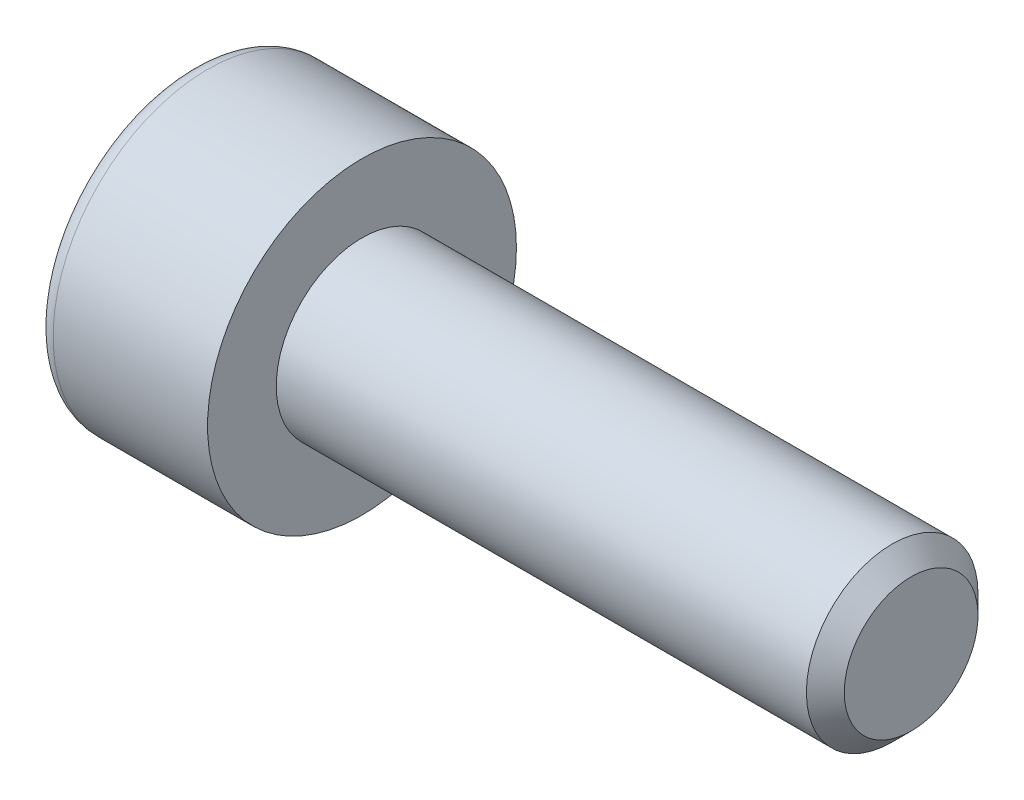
ISO-10303-21;
HEADER;
FILE_DESCRIPTION(('STEP AP214'),'2;1');
FILE_NAME('part.step','',(''),(''),'','','');
FILE_SCHEMA(('AUTOMOTIVE_DESIGN { 1 0 10303 214 1 1 1 1 }'));
ENDSEC;
DATA;
#1=APPLICATION_CONTEXT('core data for automotive mechanical design processes');
#2=APPLICATION_PROTOCOL_DEFINITION('international standard','automotive_design',2000,#1);
#3=PRODUCT_CONTEXT('',#1,'mechanical');
#4=PRODUCT('Part','Part','',(#3));
#5=PRODUCT_RELATED_PRODUCT_CATEGORY('part','',(#4));
#6=PRODUCT_DEFINITION_FORMATION('','',#4);
#7=PRODUCT_DEFINITION_CONTEXT('part definition',#1,'design');
#8=PRODUCT_DEFINITION('design','',#6,#7);
#9=PRODUCT_DEFINITION_SHAPE('','',#8);
#10=(LENGTH_UNIT() NAMED_UNIT(*) SI_UNIT(.MILLI.,.METRE.));
#11=(NAMED_UNIT(*) PLANE_ANGLE_UNIT() SI_UNIT($,.RADIAN.));
#12=(NAMED_UNIT(*) SI_UNIT($,.STERADIAN.) SOLID_ANGLE_UNIT());
#13=UNCERTAINTY_MEASURE_WITH_UNIT(LENGTH_MEASURE(1.E-05),#10,'distance_accuracy_value','');
#14=(GEOMETRIC_REPRESENTATION_CONTEXT(3) GLOBAL_UNCERTAINTY_ASSIGNED_CONTEXT((#13)) GLOBAL_UNIT_ASSIGNED_CONTEXT((#10,
#11,#12)) REPRESENTATION_CONTEXT('',''));
#15=CARTESIAN_POINT('',(0.,0.,0.));
#16=DIRECTION('',(0.,0.,1.));
#17=DIRECTION('',(1.,0.,0.));
#18=AXIS2_PLACEMENT_3D('',#15,#16,#17);
#19=CARTESIAN_POINT('',(-0.849999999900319,0.,0.));
#20=DIRECTION('',(-1.,0.,0.));
#21=DIRECTION('',(0.,-1.,0.));
#22=AXIS2_PLACEMENT_3D('',#19,#20,#21);
#23=CONICAL_SURFACE('',#22,0.952380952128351,1.04719755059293);
#24=CARTESIAN_POINT('',(-0.300142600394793,-3.97903932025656E-10,0.));
#25=VERTEX_POINT('',#24);
#26=VERTEX_LOOP('',#25);
#27=FACE_BOUND('',#26,.T.);
#28=CARTESIAN_POINT('',(-0.850000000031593,0.,0.));
#29=DIRECTION('',(-1.,0.,0.));
#30=DIRECTION('',(0.,-1.,0.));
#31=AXIS2_PLACEMENT_3D('',#28,#29,#30);
#32=CIRCLE('',#31,0.952380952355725);
#33=CARTESIAN_POINT('',(-0.850000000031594,-0.952380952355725,0.));
#34=VERTEX_POINT('',#33);
#35=EDGE_CURVE('E362',#34,#34,#32,.T.);
#36=ORIENTED_EDGE('',*,*,#35,.T.);
#37=EDGE_LOOP('',(#36));
#38=FACE_BOUND('',#37,.T.);
#39=ADVANCED_FACE('F17',(#27,#38),#23,.F.);
#40=CARTESIAN_POINT('',(-0.85,0.574463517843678,0.995));
#41=DIRECTION('',(0.,0.,1.));
#42=DIRECTION('',(1.,0.,0.));
#43=AXIS2_PLACEMENT_3D('',#40,#41,#42);
#44=PLANE('',#43);
#45=DIRECTION('',(1.,0.,0.));
#46=VECTOR('',#45,1.);
#47=CARTESIAN_POINT('',(-0.85,-0.574463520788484,0.994999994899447));
#48=LINE('',#47,#46);
#49=CARTESIAN_POINT('',(-0.85,-0.574463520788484,0.994999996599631));
#50=VERTEX_POINT('',#49);
#51=CARTESIAN_POINT('',(-2.4989270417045,-0.574463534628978,0.994999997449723));
#52=VERTEX_POINT('',#51);
#53=EDGE_CURVE('E276',#50,#52,#48,.F.);
#54=ORIENTED_EDGE('',*,*,#53,.T.);
#55=CARTESIAN_POINT('',(-2.34499999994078,0.,0.995000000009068));
#56=CARTESIAN_POINT('',(-2.34497439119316,-0.0305677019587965,0.995000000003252));
#57=CARTESIAN_POINT('',(-2.34640800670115,-0.0611198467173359,0.99500000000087));
#58=CARTESIAN_POINT('',(-2.35199243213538,-0.1219221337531,0.994999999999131));
#59=CARTESIAN_POINT('',(-2.35613836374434,-0.152172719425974,0.994999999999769));
#60=CARTESIAN_POINT('',(-2.36686597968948,-0.211759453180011,0.995000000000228));
#61=CARTESIAN_POINT('',(-2.3734099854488,-0.241102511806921,0.995000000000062));
#62=CARTESIAN_POINT('',(-2.38864217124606,-0.299229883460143,0.994999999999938));
#63=CARTESIAN_POINT('',(-2.39733102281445,-0.328014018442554,0.99499999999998));
#64=CARTESIAN_POINT('',(-2.41947932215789,-0.393688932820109,0.995000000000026));
#65=CARTESIAN_POINT('',(-2.43358464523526,-0.430359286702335,0.995000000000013));
#66=CARTESIAN_POINT('',(-2.46443795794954,-0.503023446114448,0.994999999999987));
#67=CARTESIAN_POINT('',(-2.48121157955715,-0.539006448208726,0.994999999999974));
#68=CARTESIAN_POINT('',(-2.49892704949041,-0.574463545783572,0.995));
#69=B_SPLINE_CURVE_WITH_KNOTS('',3,(#55,#56,#57,#58,#59,#60,#61,#62,#63,#64,#65,#66,#67,#68),
.UNSPECIFIED.,.F.,.F.,(4,2,2,2,2,2,4),(0.,0.0916446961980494,0.183125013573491,
0.273225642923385,0.36335451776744,0.48111795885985,0.600089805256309),.UNSPECIFIED.);
#70=CARTESIAN_POINT('',(-2.3449999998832,0.,0.99500000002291));
#71=VERTEX_POINT('',#70);
#72=EDGE_CURVE('E95',#71,#52,#69,.T.);
#73=ORIENTED_EDGE('',*,*,#72,.F.);
#74=CARTESIAN_POINT('',(-2.49892703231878,0.574463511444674,0.995));
#75=CARTESIAN_POINT('',(-2.47907510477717,0.53472221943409,0.995));
#76=CARTESIAN_POINT('',(-2.46039598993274,0.494309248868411,0.995));
#77=CARTESIAN_POINT('',(-2.42621425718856,0.41187206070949,0.995));
#78=CARTESIAN_POINT('',(-2.41073261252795,0.369839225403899,0.995));
#79=CARTESIAN_POINT('',(-2.38444123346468,0.285641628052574,0.995));
#80=CARTESIAN_POINT('',(-2.37350879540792,0.243516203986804,0.995));
#81=CARTESIAN_POINT('',(-2.35666503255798,0.158361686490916,0.995));
#82=CARTESIAN_POINT('',(-2.35073836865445,0.115335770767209,0.995));
#83=CARTESIAN_POINT('',(-2.34674431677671,0.0601561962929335,0.995));
#84=CARTESIAN_POINT('',(-2.34609249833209,0.0481633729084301,0.995));
#85=CARTESIAN_POINT('',(-2.34521965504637,0.0241145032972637,0.995));
#86=CARTESIAN_POINT('',(-2.34500034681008,0.0120583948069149,0.995));
#87=CARTESIAN_POINT('',(-2.34499999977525,0.,0.995));
#88=B_SPLINE_CURVE_WITH_KNOTS('',3,(#74,#75,#76,#77,#78,#79,#80,#81,#82,#83,#84,#85,#86,#87),
.UNSPECIFIED.,.F.,.F.,(4,2,2,2,2,2,4),(0.,0.133369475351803,0.267587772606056,0.397905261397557,
0.527821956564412,0.563847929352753,0.600016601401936),.UNSPECIFIED.);
#89=CARTESIAN_POINT('',(-2.49892703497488,0.574463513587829,0.995000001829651));
#90=VERTEX_POINT('',#89);
#91=EDGE_CURVE('E89',#90,#71,#88,.T.);
#92=ORIENTED_EDGE('',*,*,#91,.F.);
#93=DIRECTION('',(1.,0.,0.));
#94=VECTOR('',#93,1.);
#95=CARTESIAN_POINT('',(-0.85,0.574463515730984,0.995000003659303));
#96=LINE('',#95,#94);
#97=CARTESIAN_POINT('',(-0.85,0.574463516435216,0.995000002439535));
#98=VERTEX_POINT('',#97);
#99=EDGE_CURVE('E93',#90,#98,#96,.T.);
#100=ORIENTED_EDGE('',*,*,#99,.T.);
#101=DIRECTION('',(0.,1.,0.));
#102=VECTOR('',#101,1.);
#103=CARTESIAN_POINT('',(-0.85,0.,0.995));
#104=LINE('',#103,#102);
#105=EDGE_CURVE('E107',#98,#50,#104,.F.);
#106=ORIENTED_EDGE('',*,*,#105,.T.);
#107=EDGE_LOOP('',(#54,#73,#92,#100,#106));
#108=FACE_BOUND('',#107,.T.);
#109=ADVANCED_FACE('F92',(#108),#44,.F.);
#110=CARTESIAN_POINT('',(-0.85,0.,0.));
#111=DIRECTION('',(1.,0.,0.));
#112=DIRECTION('',(0.,0.,-1.));
#113=AXIS2_PLACEMENT_3D('',#110,#111,#112);
#114=PLANE('',#113);
#115=DIRECTION('',(0.,1.,0.));
#116=VECTOR('',#115,1.);
#117=CARTESIAN_POINT('',(-0.85,-0.574463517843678,-0.995));
#118=LINE('',#117,#116);
#119=CARTESIAN_POINT('',(-0.85,0.574463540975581,-0.994999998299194));
#120=VERTEX_POINT('',#119);
#121=CARTESIAN_POINT('',(-0.85,-0.5744635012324,-0.995000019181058));
#122=VERTEX_POINT('',#121);
#123=EDGE_CURVE('E266',#120,#122,#118,.F.);
#124=ORIENTED_EDGE('',*,*,#123,.T.);
#125=DIRECTION('',(0.,0.5,-0.866025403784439));
#126=VECTOR('',#125,1.);
#127=CARTESIAN_POINT('',(-0.85,-1.14892703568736,0.));
#128=LINE('',#127,#126);
#129=CARTESIAN_POINT('',(-0.85,-1.14892703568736,0.));
#130=VERTEX_POINT('',#129);
#131=EDGE_CURVE('E115',#122,#130,#128,.F.);
#132=ORIENTED_EDGE('',*,*,#131,.T.);
#133=DIRECTION('',(0.,-0.5,-0.866025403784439));
#134=VECTOR('',#133,1.);
#135=CARTESIAN_POINT('',(-0.85,-0.574463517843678,0.995));
#136=LINE('',#135,#134);
#137=EDGE_CURVE('E368',#130,#50,#136,.F.);
#138=ORIENTED_EDGE('',*,*,#137,.T.);
#139=ORIENTED_EDGE('',*,*,#105,.F.);
#140=DIRECTION('',(0.,-0.5,0.866025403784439));
#141=VECTOR('',#140,1.);
#142=CARTESIAN_POINT('',(-0.85,1.14892703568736,0.));
#143=LINE('',#142,#141);
#144=CARTESIAN_POINT('',(-0.85,1.14892703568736,0.));
#145=VERTEX_POINT('',#144);
#146=EDGE_CURVE('E106',#98,#145,#143,.F.);
#147=ORIENTED_EDGE('',*,*,#146,.T.);
#148=DIRECTION('',(0.,0.5,0.866025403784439));
#149=VECTOR('',#148,1.);
#150=CARTESIAN_POINT('',(-0.85,0.574463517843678,-0.995));
#151=LINE('',#150,#149);
#152=EDGE_CURVE('E268',#145,#120,#151,.F.);
#153=ORIENTED_EDGE('',*,*,#152,.T.);
#154=EDGE_LOOP('',(#124,#132,#138,#139,#147,#153));
#155=FACE_BOUND('',#154,.T.);
#156=ORIENTED_EDGE('',*,*,#35,.F.);
#157=EDGE_LOOP('',(#156));
#158=FACE_BOUND('',#157,.T.);
#159=ADVANCED_FACE('F165',(#155,#158),#114,.F.);
#160=CARTESIAN_POINT('',(-0.85,1.14892703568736,0.));
#161=DIRECTION('',(0.,0.866025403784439,0.5));
#162=DIRECTION('',(0.,-0.5,0.866025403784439));
#163=AXIS2_PLACEMENT_3D('',#160,#161,#162);
#164=PLANE('',#163);
#165=ORIENTED_EDGE('',*,*,#99,.F.);
#166=CARTESIAN_POINT('',(-2.49892703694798,0.574463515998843,0.995000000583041));
#167=CARTESIAN_POINT('',(-2.47920127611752,0.594208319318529,0.960800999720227));
#168=CARTESIAN_POINT('',(-2.46063414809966,0.614283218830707,0.926030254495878));
#169=CARTESIAN_POINT('',(-2.4266385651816,0.655218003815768,0.855129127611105));
#170=CARTESIAN_POINT('',(-2.41122901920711,0.676081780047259,0.818992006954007));
#171=CARTESIAN_POINT('',(-2.38483287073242,0.71815225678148,0.746123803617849));
#172=CARTESIAN_POINT('',(-2.37377985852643,0.739348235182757,0.709411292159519));
#173=CARTESIAN_POINT('',(-2.35674986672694,0.782206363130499,0.635178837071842));
#174=CARTESIAN_POINT('',(-2.35076018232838,0.803867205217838,0.59766115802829));
#175=CARTESIAN_POINT('',(-2.34535763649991,0.841202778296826,0.532994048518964));
#176=CARTESIAN_POINT('',(-2.34455932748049,0.856829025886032,0.505928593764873));
#177=CARTESIAN_POINT('',(-2.34590474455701,0.888051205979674,0.451850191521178));
#178=CARTESIAN_POINT('',(-2.34804912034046,0.90364713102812,0.424837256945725));
#179=CARTESIAN_POINT('',(-2.35875462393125,0.950212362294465,0.344183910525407));
#180=CARTESIAN_POINT('',(-2.37158937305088,0.9809498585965,0.290945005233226));
#181=CARTESIAN_POINT('',(-2.40257138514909,1.03491361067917,0.197477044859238));
#182=CARTESIAN_POINT('',(-2.41909924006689,1.05839226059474,0.156810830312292));
#183=CARTESIAN_POINT('',(-2.4563312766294,1.10442922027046,0.0770724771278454));
#184=CARTESIAN_POINT('',(-2.47702183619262,1.12699025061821,0.0379956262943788));
#185=CARTESIAN_POINT('',(-2.49914390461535,1.14914384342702,-0.000375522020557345));
#186=B_SPLINE_CURVE_WITH_KNOTS('',3,(#166,#167,#168,#169,#170,#171,#172,#173,#174,#175,#176,
#177,#178,#179,#180,#181,#182,#183,#184,#185),.UNSPECIFIED.,.F.,.F.,(4,2,2,2,2,2,2,2,2,4),(0.,
0.132518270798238,0.265808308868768,0.396979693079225,0.527820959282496,0.621473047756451,
0.715145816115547,0.902546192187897,1.05168981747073,1.20035309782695),.UNSPECIFIED.);
#187=CARTESIAN_POINT('',(-2.49966772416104,1.14925824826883,-7.0398023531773E-06));
#188=VERTEX_POINT('',#187);
#189=EDGE_CURVE('E104',#90,#188,#186,.T.);
#190=ORIENTED_EDGE('',*,*,#189,.T.);
#191=DIRECTION('',(1.,0.,0.));
#192=VECTOR('',#191,1.);
#193=CARTESIAN_POINT('',(-0.85,1.14892703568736,0.));
#194=LINE('',#193,#192);
#195=EDGE_CURVE('E367',#188,#145,#194,.T.);
#196=ORIENTED_EDGE('',*,*,#195,.T.);
#197=ORIENTED_EDGE('',*,*,#146,.F.);
#198=EDGE_LOOP('',(#165,#190,#196,#197));
#199=FACE_BOUND('',#198,.T.);
#200=ADVANCED_FACE('F102',(#199),#164,.F.);
#201=CARTESIAN_POINT('',(-0.85,-0.574463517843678,0.995));
#202=DIRECTION('',(0.,-0.866025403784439,0.5));
#203=DIRECTION('',(0.,-0.5,-0.866025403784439));
#204=AXIS2_PLACEMENT_3D('',#201,#202,#203);
#205=PLANE('',#204);
#206=DIRECTION('',(-1.,0.,0.));
#207=VECTOR('',#206,1.);
#208=CARTESIAN_POINT('',(-0.85,-1.14892703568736,0.));
#209=LINE('',#208,#207);
#210=CARTESIAN_POINT('',(-2.49966773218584,-1.14925825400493,-7.06998222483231E-06));
#211=VERTEX_POINT('',#210);
#212=EDGE_CURVE('E138',#130,#211,#209,.T.);
#213=ORIENTED_EDGE('',*,*,#212,.T.);
#214=CARTESIAN_POINT('',(-2.49914391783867,-1.14914385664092,-0.000375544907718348));
#215=CARTESIAN_POINT('',(-2.47939437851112,-1.12938634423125,0.0338454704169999));
#216=CARTESIAN_POINT('',(-2.46080382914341,-1.10929839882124,0.0686388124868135));
#217=CARTESIAN_POINT('',(-2.42676345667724,-1.06833625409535,0.139587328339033));
#218=CARTESIAN_POINT('',(-2.41133259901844,-1.04745814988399,0.175749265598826));
#219=CARTESIAN_POINT('',(-2.38489828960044,-1.00535786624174,0.248669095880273));
#220=CARTESIAN_POINT('',(-2.373828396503,-0.984146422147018,0.285408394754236));
#221=CARTESIAN_POINT('',(-2.35677144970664,-0.941256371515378,0.359696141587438));
#222=CARTESIAN_POINT('',(-2.35077164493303,-0.919579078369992,0.397242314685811));
#223=CARTESIAN_POINT('',(-2.34536074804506,-0.88222607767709,0.461939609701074));
#224=CARTESIAN_POINT('',(-2.34456000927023,-0.866599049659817,0.489006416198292));
#225=CARTESIAN_POINT('',(-2.34590089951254,-0.835375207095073,0.543087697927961));
#226=CARTESIAN_POINT('',(-2.34804317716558,-0.819778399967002,0.570102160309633));
#227=CARTESIAN_POINT('',(-2.35874295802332,-0.773210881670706,0.650759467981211));
#228=CARTESIAN_POINT('',(-2.37157459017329,-0.742471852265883,0.704001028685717));
#229=CARTESIAN_POINT('',(-2.40253243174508,-0.688540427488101,0.797412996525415));
#230=CARTESIAN_POINT('',(-2.41903073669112,-0.665094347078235,0.838022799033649));
#231=CARTESIAN_POINT('',(-2.45619424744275,-0.619119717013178,0.91765319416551));
#232=CARTESIAN_POINT('',(-2.47684592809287,-0.596588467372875,0.956678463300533));
#233=CARTESIAN_POINT('',(-2.49892698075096,-0.574463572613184,0.994999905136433));
#234=B_SPLINE_CURVE_WITH_KNOTS('',3,(#214,#215,#216,#217,#218,#219,#220,#221,#222,#223,#224,
#225,#226,#227,#228,#229,#230,#231,#232,#233),.UNSPECIFIED.,.F.,.F.,(4,2,2,2,2,2,2,2,2,4),(0.,
0.132618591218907,0.266011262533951,0.397284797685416,0.528227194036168,0.621884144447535,
0.715561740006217,0.9029688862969,1.05189958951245,1.2003529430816),.UNSPECIFIED.);
#235=EDGE_CURVE('E117',#211,#52,#234,.T.);
#236=ORIENTED_EDGE('',*,*,#235,.T.);
#237=ORIENTED_EDGE('',*,*,#53,.F.);
#238=ORIENTED_EDGE('',*,*,#137,.F.);
#239=EDGE_LOOP('',(#213,#236,#237,#238));
#240=FACE_BOUND('',#239,.T.);
#241=ADVANCED_FACE('F174',(#240),#205,.F.);
#242=CARTESIAN_POINT('',(-0.85,0.574463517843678,-0.995));
#243=DIRECTION('',(0.,0.866025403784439,-0.5));
#244=DIRECTION('',(0.,0.5,0.866025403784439));
#245=AXIS2_PLACEMENT_3D('',#242,#243,#244);
#246=PLANE('',#245);
#247=ORIENTED_EDGE('',*,*,#195,.F.);
#248=CARTESIAN_POINT('',(-2.49913902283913,1.14913896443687,0.00036707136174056));
#249=CARTESIAN_POINT('',(-2.47939002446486,1.12938174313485,-0.0338534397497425));
#250=CARTESIAN_POINT('',(-2.46080000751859,1.10929409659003,-0.0686462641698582));
#251=CARTESIAN_POINT('',(-2.42676065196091,1.06833257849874,-0.139593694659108));
#252=CARTESIAN_POINT('',(-2.41133027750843,1.04745480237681,-0.17575506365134));
#253=CARTESIAN_POINT('',(-2.38489682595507,1.00535519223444,-0.248673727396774));
#254=CARTESIAN_POINT('',(-2.37382730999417,0.98414409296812,-0.285412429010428));
#255=CARTESIAN_POINT('',(-2.35677096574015,0.941254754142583,-0.359698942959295));
#256=CARTESIAN_POINT('',(-2.35077138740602,0.919577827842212,-0.397244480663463));
#257=CARTESIAN_POINT('',(-2.34536067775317,0.88222521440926,-0.461941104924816));
#258=CARTESIAN_POINT('',(-2.3445599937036,0.866598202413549,-0.489007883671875));
#259=CARTESIAN_POINT('',(-2.34590098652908,0.835374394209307,-0.543089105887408));
#260=CARTESIAN_POINT('',(-2.3480433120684,0.819777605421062,-0.570103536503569));
#261=CARTESIAN_POINT('',(-2.35874322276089,0.773210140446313,-0.65076075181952));
#262=CARTESIAN_POINT('',(-2.37157492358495,0.742471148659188,-0.704002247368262));
#263=CARTESIAN_POINT('',(-2.40253280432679,0.688539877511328,-0.797413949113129));
#264=CARTESIAN_POINT('',(-2.41903106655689,0.665093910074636,-0.838023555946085));
#265=CARTESIAN_POINT('',(-2.45619444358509,0.619119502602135,-0.917653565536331));
#266=CARTESIAN_POINT('',(-2.47684603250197,0.59658836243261,-0.956678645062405));
#267=CARTESIAN_POINT('',(-2.49892698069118,0.574463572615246,-0.994999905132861));
#268=B_SPLINE_CURVE_WITH_KNOTS('',3,(#248,#249,#250,#251,#252,#253,#254,#255,#256,#257,#258,
#259,#260,#261,#262,#263,#264,#265,#266,#267),.UNSPECIFIED.,.F.,.F.,(4,2,2,2,2,2,2,2,2,4),(0.,
0.13261629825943,0.266006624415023,0.397277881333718,0.528218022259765,0.621874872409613,
0.715552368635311,0.902959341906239,1.05188936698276,1.20034201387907),.UNSPECIFIED.);
#269=CARTESIAN_POINT('',(-2.4989270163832,0.574463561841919,-0.99499995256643));
#270=VERTEX_POINT('',#269);
#271=EDGE_CURVE('E244',#188,#270,#268,.T.);
#272=ORIENTED_EDGE('',*,*,#271,.T.);
#273=DIRECTION('',(-1.,0.,0.));
#274=VECTOR('',#273,1.);
#275=CARTESIAN_POINT('',(-0.85,0.574463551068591,-0.995));
#276=LINE('',#275,#274);
#277=EDGE_CURVE('E262',#270,#120,#276,.F.);
#278=ORIENTED_EDGE('',*,*,#277,.T.);
#279=ORIENTED_EDGE('',*,*,#152,.F.);
#280=EDGE_LOOP('',(#247,#272,#278,#279));
#281=FACE_BOUND('',#280,.T.);
#282=ADVANCED_FACE('F245',(#281),#246,.F.);
#283=CARTESIAN_POINT('',(-0.85,-0.574463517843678,-0.995));
#284=DIRECTION('',(0.,0.,-1.));
#285=DIRECTION('',(-1.,0.,0.));
#286=AXIS2_PLACEMENT_3D('',#283,#284,#285);
#287=PLANE('',#286);
#288=ORIENTED_EDGE('',*,*,#277,.F.);
#289=CARTESIAN_POINT('',(-2.49892706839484,0.574463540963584,-0.994999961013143));
#290=CARTESIAN_POINT('',(-2.47920147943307,0.534974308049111,-0.994999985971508));
#291=CARTESIAN_POINT('',(-2.46063450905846,0.494824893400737,-0.994999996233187));
#292=CARTESIAN_POINT('',(-2.4266391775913,0.412956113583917,-0.995000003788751));
#293=CARTESIAN_POINT('',(-2.4112297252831,0.371228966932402,-0.995000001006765));
#294=CARTESIAN_POINT('',(-2.38483341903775,0.287088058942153,-0.994999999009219));
#295=CARTESIAN_POINT('',(-2.37378023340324,0.244695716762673,-0.994999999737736));
#296=CARTESIAN_POINT('',(-2.35674998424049,0.158978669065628,-0.995000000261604));
#297=CARTESIAN_POINT('',(-2.35076021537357,0.115656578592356,-0.995000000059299));
#298=CARTESIAN_POINT('',(-2.34535762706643,0.040984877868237,-0.994999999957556));
#299=CARTESIAN_POINT('',(-2.34455931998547,0.00973223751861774,-0.994999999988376));
#300=CARTESIAN_POINT('',(-2.34590477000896,-0.0527124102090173,-0.995000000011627));
#301=CARTESIAN_POINT('',(-2.34804917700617,-0.0839044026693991,-0.99500000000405));
#302=CARTESIAN_POINT('',(-2.35875473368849,-0.177034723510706,-0.994999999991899));
#303=CARTESIAN_POINT('',(-2.37158942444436,-0.238509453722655,-0.994999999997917));
#304=CARTESIAN_POINT('',(-2.40254901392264,-0.346358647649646,-0.995000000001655));
#305=CARTESIAN_POINT('',(-2.41904541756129,-0.393240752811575,-0.995000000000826));
#306=CARTESIAN_POINT('',(-2.4562029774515,-0.485170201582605,-0.994999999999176));
#307=CARTESIAN_POINT('',(-2.47685057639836,-0.530222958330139,-0.994999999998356));
#308=CARTESIAN_POINT('',(-2.4989269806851,-0.574463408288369,-0.995));
#309=B_SPLINE_CURVE_WITH_KNOTS('',3,(#289,#290,#291,#292,#293,#294,#295,#296,#297,#298,#299,
#300,#301,#302,#303,#304,#305,#306,#307,#308),.UNSPECIFIED.,.F.,.F.,(4,2,2,2,2,2,2,2,2,4),(0.,
0.132517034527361,0.265805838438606,0.396978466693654,0.52782096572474,0.621473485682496,
0.715146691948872,0.90254619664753,1.05144671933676,1.1998686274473),.UNSPECIFIED.);
#310=CARTESIAN_POINT('',(-2.49892701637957,-0.574463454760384,-0.995000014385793));
#311=VERTEX_POINT('',#310);
#312=EDGE_CURVE('E219',#270,#311,#309,.T.);
#313=ORIENTED_EDGE('',*,*,#312,.T.);
#314=DIRECTION('',(1.,0.,0.));
#315=VECTOR('',#314,1.);
#316=CARTESIAN_POINT('',(-0.85,-0.5744635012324,-0.995000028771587));
#317=LINE('',#316,#315);
#318=EDGE_CURVE('E120',#311,#122,#317,.T.);
#319=ORIENTED_EDGE('',*,*,#318,.T.);
#320=ORIENTED_EDGE('',*,*,#123,.F.);
#321=EDGE_LOOP('',(#288,#313,#319,#320));
#322=FACE_BOUND('',#321,.T.);
#323=ADVANCED_FACE('F248',(#322),#287,.F.);
#324=CARTESIAN_POINT('',(-0.85,-1.14892703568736,0.));
#325=DIRECTION('',(0.,-0.866025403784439,-0.5));
#326=DIRECTION('',(0.,0.5,-0.866025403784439));
#327=AXIS2_PLACEMENT_3D('',#324,#325,#326);
#328=PLANE('',#327);
#329=ORIENTED_EDGE('',*,*,#318,.F.);
#330=CARTESIAN_POINT('',(-2.49892706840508,-0.574463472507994,-0.995000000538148));
#331=CARTESIAN_POINT('',(-2.47920129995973,-0.594208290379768,-0.96080102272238));
#332=CARTESIAN_POINT('',(-2.46063417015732,-0.614283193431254,-0.926030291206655));
#333=CARTESIAN_POINT('',(-2.42663858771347,-0.655217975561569,-0.855129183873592));
#334=CARTESIAN_POINT('',(-2.41122904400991,-0.676081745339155,-0.818992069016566));
#335=CARTESIAN_POINT('',(-2.38483289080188,-0.718152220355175,-0.746123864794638));
#336=CARTESIAN_POINT('',(-2.37377987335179,-0.739348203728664,-0.709411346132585));
#337=CARTESIAN_POINT('',(-2.35674987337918,-0.782206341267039,-0.63517887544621));
#338=CARTESIAN_POINT('',(-2.35076018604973,-0.803867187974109,-0.597661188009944));
#339=CARTESIAN_POINT('',(-2.34535763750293,-0.841202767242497,-0.532994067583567));
#340=CARTESIAN_POINT('',(-2.34455932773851,-0.856829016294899,-0.50592861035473));
#341=CARTESIAN_POINT('',(-2.34590474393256,-0.888051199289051,-0.451850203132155));
#342=CARTESIAN_POINT('',(-2.34804911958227,-0.903647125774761,-0.42483726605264));
#343=CARTESIAN_POINT('',(-2.3587546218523,-0.95021235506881,-0.344183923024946));
#344=CARTESIAN_POINT('',(-2.37158936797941,-0.980949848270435,-0.290945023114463));
#345=CARTESIAN_POINT('',(-2.40257087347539,-1.03491272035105,-0.197478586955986));
#346=CARTESIAN_POINT('',(-2.41909802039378,-1.05839052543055,-0.156813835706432));
#347=CARTESIAN_POINT('',(-2.45632838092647,-1.10442586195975,-0.0770782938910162));
#348=CARTESIAN_POINT('',(-2.47701797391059,-1.12698611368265,-0.0380027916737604));
#349=CARTESIAN_POINT('',(-2.49913901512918,-1.14913895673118,0.000367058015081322));
#350=B_SPLINE_CURVE_WITH_KNOTS('',3,(#330,#331,#332,#333,#334,#335,#336,#337,#338,#339,#340,
#341,#342,#343,#344,#345,#346,#347,#348,#349),.UNSPECIFIED.,.F.,.F.,(4,2,2,2,2,2,2,2,2,4),(0.,
0.132518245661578,0.265808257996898,0.39697967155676,0.52782096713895,0.621473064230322,
0.715145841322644,0.902546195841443,1.05168435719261,1.20034221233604),.UNSPECIFIED.);
#351=EDGE_CURVE('E214',#311,#211,#350,.T.);
#352=ORIENTED_EDGE('',*,*,#351,.T.);
#353=ORIENTED_EDGE('',*,*,#212,.F.);
#354=ORIENTED_EDGE('',*,*,#131,.F.);
#355=EDGE_LOOP('',(#329,#352,#353,#354));
#356=FACE_BOUND('',#355,.T.);
#357=ADVANCED_FACE('F146',(#356),#328,.F.);
#358=CARTESIAN_POINT('',(-2.50093169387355,0.,0.));
#359=DIRECTION('',(-1.,0.,0.));
#360=DIRECTION('',(0.,0.,1.));
#361=AXIS2_PLACEMENT_3D('',#358,#359,#360);
#362=CONICAL_SURFACE('',#361,1.1509316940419,0.785398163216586);
#363=CARTESIAN_POINT('',(-2.5,0.,0.));
#364=DIRECTION('',(-1.,0.,0.));
#365=DIRECTION('',(0.,0.,1.));
#366=AXIS2_PLACEMENT_3D('',#363,#364,#365);
#367=CIRCLE('',#366,1.15000000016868);
#368=CARTESIAN_POINT('',(-2.49999999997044,0.,1.15000000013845));
#369=VERTEX_POINT('',#368);
#370=EDGE_CURVE('E112',#188,#369,#367,.F.);
#371=ORIENTED_EDGE('',*,*,#370,.F.);
#372=ORIENTED_EDGE('',*,*,#189,.F.);
#373=ORIENTED_EDGE('',*,*,#91,.T.);
#374=DIRECTION('',(0.707106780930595,0.,-0.7071067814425));
#375=VECTOR('',#374,1.);
#376=CARTESIAN_POINT('',(-499000.,0.,498998.650361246));
#377=LINE('',#376,#375);
#378=EDGE_CURVE('E114',#71,#369,#377,.F.);
#379=ORIENTED_EDGE('',*,*,#378,.T.);
#380=EDGE_LOOP('',(#371,#372,#373,#379));
#381=FACE_BOUND('',#380,.T.);
#382=ADVANCED_FACE('F110',(#381),#362,.F.);
#383=CARTESIAN_POINT('',(-2.50093106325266,0.,0.));
#384=DIRECTION('',(-1.,0.,0.));
#385=DIRECTION('',(0.,0.,1.));
#386=AXIS2_PLACEMENT_3D('',#383,#384,#385);
#387=CONICAL_SURFACE('',#386,1.15093106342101,0.785398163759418);
#388=ORIENTED_EDGE('',*,*,#235,.F.);
#389=CARTESIAN_POINT('',(-2.5,0.,0.));
#390=DIRECTION('',(-1.,0.,0.));
#391=DIRECTION('',(0.,0.,1.));
#392=AXIS2_PLACEMENT_3D('',#389,#390,#391);
#393=CIRCLE('',#392,1.15000000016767);
#394=EDGE_CURVE('E206',#369,#211,#393,.F.);
#395=ORIENTED_EDGE('',*,*,#394,.F.);
#396=ORIENTED_EDGE('',*,*,#378,.F.);
#397=ORIENTED_EDGE('',*,*,#72,.T.);
#398=EDGE_LOOP('',(#388,#395,#396,#397));
#399=FACE_BOUND('',#398,.T.);
#400=ADVANCED_FACE('F145',(#399),#387,.F.);
#401=CARTESIAN_POINT('',(-2.49946090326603,0.,0.));
#402=DIRECTION('',(-1.,0.,0.));
#403=DIRECTION('',(0.,0.,1.));
#404=AXIS2_PLACEMENT_3D('',#401,#402,#403);
#405=CONICAL_SURFACE('',#404,1.14946090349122,0.785398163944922);
#406=ORIENTED_EDGE('',*,*,#312,.F.);
#407=ORIENTED_EDGE('',*,*,#271,.F.);
#408=CARTESIAN_POINT('',(-2.5,0.,0.));
#409=DIRECTION('',(-1.,0.,0.));
#410=DIRECTION('',(0.,0.,1.));
#411=AXIS2_PLACEMENT_3D('',#408,#409,#410);
#412=CIRCLE('',#411,1.15000000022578);
#413=EDGE_CURVE('E202',#211,#188,#412,.F.);
#414=ORIENTED_EDGE('',*,*,#413,.F.);
#415=ORIENTED_EDGE('',*,*,#351,.F.);
#416=EDGE_LOOP('',(#406,#407,#414,#415));
#417=FACE_BOUND('',#416,.T.);
#418=ADVANCED_FACE('F229',(#417),#405,.F.);
#419=CARTESIAN_POINT('',(-2.5,1.575,0.));
#420=DIRECTION('',(-1.,0.,0.));
#421=DIRECTION('',(0.,0.,1.));
#422=AXIS2_PLACEMENT_3D('',#419,#420,#421);
#423=PLANE('',#422);
#424=CARTESIAN_POINT('',(-2.5,0.,0.));
#425=DIRECTION('',(1.,0.,0.));
#426=DIRECTION('',(0.,0.,-1.));
#427=AXIS2_PLACEMENT_3D('',#424,#425,#426);
#428=CIRCLE('',#427,2.);
#429=CARTESIAN_POINT('',(-2.5,0.,-1.99999999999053));
#430=VERTEX_POINT('',#429);
#431=CARTESIAN_POINT('',(-2.5,2.,0.));
#432=VERTEX_POINT('',#431);
#433=EDGE_CURVE('E205',#430,#432,#428,.T.);
#434=ORIENTED_EDGE('',*,*,#433,.F.);
#435=CARTESIAN_POINT('',(-2.5,0.,0.));
#436=DIRECTION('',(1.,0.,0.));
#437=DIRECTION('',(0.,0.,1.));
#438=AXIS2_PLACEMENT_3D('',#435,#436,#437);
#439=CIRCLE('',#438,1.99999999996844);
#440=CARTESIAN_POINT('',(-2.5,-3.94345103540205E-08,1.99999999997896));
#441=VERTEX_POINT('',#440);
#442=EDGE_CURVE('E291',#441,#430,#439,.T.);
#443=ORIENTED_EDGE('',*,*,#442,.F.);
#444=CARTESIAN_POINT('',(-2.5,0.,0.));
#445=DIRECTION('',(1.,0.,0.));
#446=DIRECTION('',(0.,1.,0.));
#447=AXIS2_PLACEMENT_3D('',#444,#445,#446);
#448=CIRCLE('',#447,2.);
#449=EDGE_CURVE('E38',#432,#441,#448,.T.);
#450=ORIENTED_EDGE('',*,*,#449,.F.);
#451=EDGE_LOOP('',(#434,#443,#450));
#452=FACE_BOUND('',#451,.T.);
#453=ORIENTED_EDGE('',*,*,#394,.T.);
#454=ORIENTED_EDGE('',*,*,#413,.T.);
#455=ORIENTED_EDGE('',*,*,#370,.T.);
#456=EDGE_LOOP('',(#453,#454,#455));
#457=FACE_BOUND('',#456,.T.);
#458=ADVANCED_FACE('F233',(#452,#457),#423,.T.);
#459=CARTESIAN_POINT('',(-2.25,0.,0.));
#460=DIRECTION('',(-1.,0.,0.));
#461=DIRECTION('',(0.,0.,1.));
#462=AXIS2_PLACEMENT_3D('',#459,#460,#461);
#463=TOROIDAL_SURFACE('',#462,2.,0.250000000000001);
#464=CARTESIAN_POINT('',(-2.25,0.,0.));
#465=DIRECTION('',(1.,0.,0.));
#466=DIRECTION('',(0.,0.,-1.));
#467=AXIS2_PLACEMENT_3D('',#464,#465,#466);
#468=CIRCLE('',#467,2.25);
#469=CARTESIAN_POINT('',(-2.25,0.,-2.25));
#470=VERTEX_POINT('',#469);
#471=EDGE_CURVE('E198',#470,#470,#468,.T.);
#472=ORIENTED_EDGE('',*,*,#471,.F.);
#473=EDGE_LOOP('',(#472));
#474=FACE_BOUND('',#473,.T.);
#475=ORIENTED_EDGE('',*,*,#442,.T.);
#476=ORIENTED_EDGE('',*,*,#433,.T.);
#477=ORIENTED_EDGE('',*,*,#449,.T.);
#478=EDGE_LOOP('',(#475,#476,#477));
#479=FACE_BOUND('',#478,.T.);
#480=ADVANCED_FACE('F282',(#474,#479),#463,.T.);
#481=CARTESIAN_POINT('',(-1.125,0.,0.));
#482=DIRECTION('',(1.,0.,0.));
#483=DIRECTION('',(0.,0.,-1.));
#484=AXIS2_PLACEMENT_3D('',#481,#482,#483);
#485=CYLINDRICAL_SURFACE('',#484,2.25);
#486=ORIENTED_EDGE('',*,*,#471,.T.);
#487=EDGE_LOOP('',(#486));
#488=FACE_BOUND('',#487,.T.);
#489=CARTESIAN_POINT('',(0.,0.,0.));
#490=DIRECTION('',(1.,0.,0.));
#491=DIRECTION('',(0.,0.,-1.));
#492=AXIS2_PLACEMENT_3D('',#489,#490,#491);
#493=CIRCLE('',#492,2.25);
#494=CARTESIAN_POINT('',(0.,0.,-2.25));
#495=VERTEX_POINT('',#494);
#496=EDGE_CURVE('E194',#495,#495,#493,.T.);
#497=ORIENTED_EDGE('',*,*,#496,.F.);
#498=EDGE_LOOP('',(#497));
#499=FACE_BOUND('',#498,.T.);
#500=ADVANCED_FACE('F288',(#488,#499),#485,.T.);
#501=CARTESIAN_POINT('',(8.,0.487,0.));
#502=DIRECTION('',(1.,0.,0.));
#503=DIRECTION('',(0.,0.,-1.));
#504=AXIS2_PLACEMENT_3D('',#501,#502,#503);
#505=PLANE('',#504);
#506=CARTESIAN_POINT('',(7.99999999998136,0.,0.));
#507=DIRECTION('',(-1.,0.,0.));
#508=DIRECTION('',(0.,0.,1.));
#509=AXIS2_PLACEMENT_3D('',#506,#507,#508);
#510=CIRCLE('',#509,0.973999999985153);
#511=CARTESIAN_POINT('',(7.99999999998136,0.,0.973999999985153));
#512=VERTEX_POINT('',#511);
#513=EDGE_CURVE('E192',#512,#512,#510,.T.);
#514=ORIENTED_EDGE('',*,*,#513,.F.);
#515=EDGE_LOOP('',(#514));
#516=FACE_BOUND('',#515,.T.);
#517=ADVANCED_FACE('F324',(#516),#505,.T.);
#518=CARTESIAN_POINT('',(0.,1.9,0.));
#519=DIRECTION('',(1.,0.,0.));
#520=DIRECTION('',(0.,0.,-1.));
#521=AXIS2_PLACEMENT_3D('',#518,#519,#520);
#522=PLANE('',#521);
#523=CARTESIAN_POINT('',(0.,0.,0.));
#524=DIRECTION('',(1.,0.,0.));
#525=DIRECTION('',(0.,0.,-1.));
#526=AXIS2_PLACEMENT_3D('',#523,#524,#525);
#527=CIRCLE('',#526,1.25);
#528=CARTESIAN_POINT('',(0.,0.,-1.25));
#529=VERTEX_POINT('',#528);
#530=EDGE_CURVE('E29',#529,#529,#527,.T.);
#531=ORIENTED_EDGE('',*,*,#530,.F.);
#532=EDGE_LOOP('',(#531));
#533=FACE_BOUND('',#532,.T.);
#534=ORIENTED_EDGE('',*,*,#496,.T.);
#535=EDGE_LOOP('',(#534));
#536=FACE_BOUND('',#535,.T.);
#537=ADVANCED_FACE('F183',(#533,#536),#522,.T.);
#538=CARTESIAN_POINT('',(7.72400000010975,0.,0.));
#539=DIRECTION('',(-1.,0.,0.));
#540=DIRECTION('',(0.,0.,1.));
#541=AXIS2_PLACEMENT_3D('',#538,#539,#540);
#542=CONICAL_SURFACE('',#541,1.2499999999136,0.785398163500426);
#543=CARTESIAN_POINT('',(7.724,0.,0.));
#544=DIRECTION('',(1.,0.,0.));
#545=DIRECTION('',(0.,0.,-1.));
#546=AXIS2_PLACEMENT_3D('',#543,#544,#545);
#547=CIRCLE('',#546,1.25);
#548=CARTESIAN_POINT('',(7.724,0.,-1.25));
#549=VERTEX_POINT('',#548);
#550=EDGE_CURVE('E11',#549,#549,#547,.F.);
#551=ORIENTED_EDGE('',*,*,#550,.F.);
#552=EDGE_LOOP('',(#551));
#553=FACE_BOUND('',#552,.T.);
#554=ORIENTED_EDGE('',*,*,#513,.T.);
#555=EDGE_LOOP('',(#554));
#556=FACE_BOUND('',#555,.T.);
#557=ADVANCED_FACE('F177',(#553,#556),#542,.T.);
#558=CARTESIAN_POINT('',(4.117,0.,0.));
#559=DIRECTION('',(1.,0.,0.));
#560=DIRECTION('',(0.,0.,-1.));
#561=AXIS2_PLACEMENT_3D('',#558,#559,#560);
#562=CYLINDRICAL_SURFACE('',#561,1.25);
#563=ORIENTED_EDGE('',*,*,#530,.T.);
#564=EDGE_LOOP('',(#563));
#565=FACE_BOUND('',#564,.T.);
#566=ORIENTED_EDGE('',*,*,#550,.T.);
#567=EDGE_LOOP('',(#566));
#568=FACE_BOUND('',#567,.T.);
#569=ADVANCED_FACE('F19',(#565,#568),#562,.T.);
#570=CLOSED_SHELL('',(#39,#109,#159,#200,#241,#282,#323,#357,#382,#400,#418,#458,#480,#500,#517,
#537,#557,#569));
#571=MANIFOLD_SOLID_BREP('B1',#570);
#572=ADVANCED_BREP_SHAPE_REPRESENTATION('',(#18,#571),#14);
#573=SHAPE_DEFINITION_REPRESENTATION(#9,#572);
ENDSEC;
END-ISO-10303-21;
